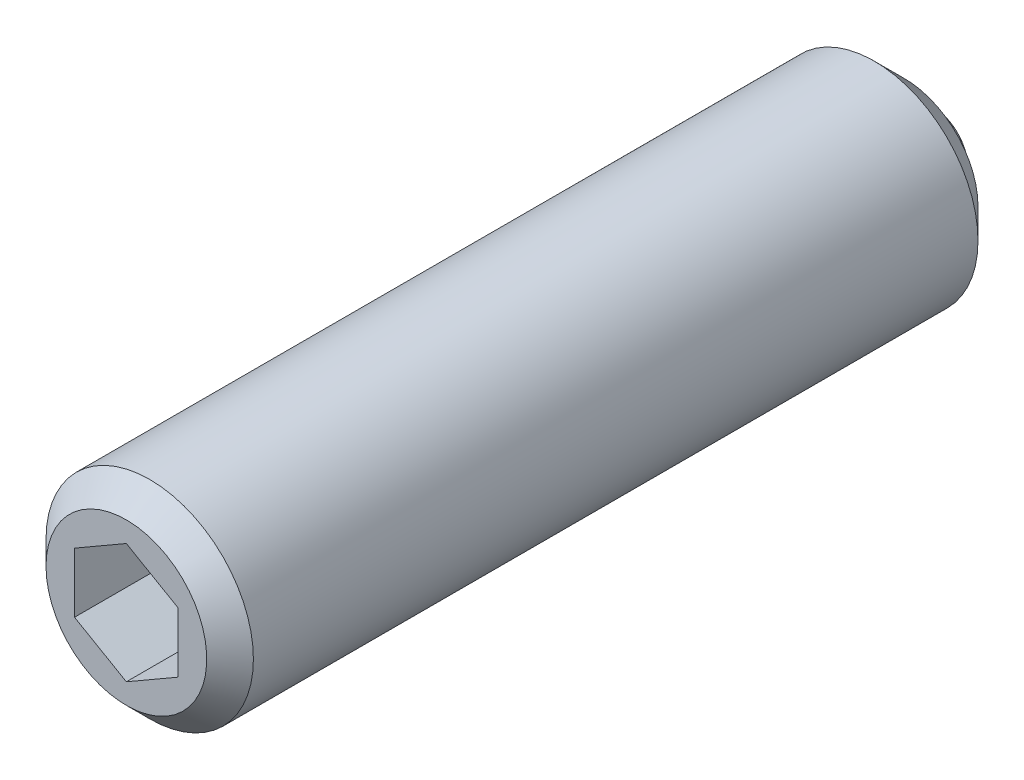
ISO-10303-21;
HEADER;
FILE_DESCRIPTION(('STEP AP214'),'2;1');
FILE_NAME('part.step','',(''),(''),'','','');
FILE_SCHEMA(('AUTOMOTIVE_DESIGN { 1 0 10303 214 1 1 1 1 }'));
ENDSEC;
DATA;
#1=APPLICATION_CONTEXT('core data for automotive mechanical design processes');
#2=APPLICATION_PROTOCOL_DEFINITION('international standard','automotive_design',2000,#1);
#3=PRODUCT_CONTEXT('',#1,'mechanical');
#4=PRODUCT('Part','Part','',(#3));
#5=PRODUCT_RELATED_PRODUCT_CATEGORY('part','',(#4));
#6=PRODUCT_DEFINITION_FORMATION('','',#4);
#7=PRODUCT_DEFINITION_CONTEXT('part definition',#1,'design');
#8=PRODUCT_DEFINITION('design','',#6,#7);
#9=PRODUCT_DEFINITION_SHAPE('','',#8);
#10=(LENGTH_UNIT() NAMED_UNIT(*) SI_UNIT(.MILLI.,.METRE.));
#11=(NAMED_UNIT(*) PLANE_ANGLE_UNIT() SI_UNIT($,.RADIAN.));
#12=(NAMED_UNIT(*) SI_UNIT($,.STERADIAN.) SOLID_ANGLE_UNIT());
#13=UNCERTAINTY_MEASURE_WITH_UNIT(LENGTH_MEASURE(1.E-05),#10,'distance_accuracy_value','');
#14=(GEOMETRIC_REPRESENTATION_CONTEXT(3) GLOBAL_UNCERTAINTY_ASSIGNED_CONTEXT((#13)) GLOBAL_UNIT_ASSIGNED_CONTEXT((#10,
#11,#12)) REPRESENTATION_CONTEXT('',''));
#15=CARTESIAN_POINT('',(0.,0.,0.));
#16=DIRECTION('',(0.,0.,1.));
#17=DIRECTION('',(1.,0.,0.));
#18=AXIS2_PLACEMENT_3D('',#15,#16,#17);
#19=CARTESIAN_POINT('',(1.03716958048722,3.87076958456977,31.5000000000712));
#20=DIRECTION('',(6.86296670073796E-11,0.,-1.));
#21=DIRECTION('',(0.500000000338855,-0.866025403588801,3.43250813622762E-11));
#22=AXIS2_PLACEMENT_3D('',#19,#20,#21);
#23=PLANE('',#22);
#24=CARTESIAN_POINT('',(-2.16183451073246E-09,3.72745200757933E-13,31.5));
#25=DIRECTION('',(6.86296670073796E-11,0.,-1.));
#26=DIRECTION('',(-1.,0.,-6.86296670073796E-11));
#27=AXIS2_PLACEMENT_3D('',#24,#25,#26);
#28=CIRCLE('',#27,3.1);
#29=CARTESIAN_POINT('',(-3.10000000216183,3.72745200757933E-13,31.4999999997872));
#30=VERTEX_POINT('',#29);
#31=EDGE_CURVE('E23',#30,#30,#28,.F.);
#32=ORIENTED_EDGE('',*,*,#31,.T.);
#33=EDGE_LOOP('',(#32));
#34=FACE_BOUND('',#33,.T.);
#35=DIRECTION('',(-0.866025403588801,-0.500000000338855,-5.94291184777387E-11));
#36=VECTOR('',#35,1.);
#37=CARTESIAN_POINT('',(-1.00000000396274,1.73205080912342,31.4999999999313));
#38=LINE('',#37,#36);
#39=CARTESIAN_POINT('',(-4.74585106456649E-09,2.30940107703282,31.5));
#40=VERTEX_POINT('',#39);
#41=CARTESIAN_POINT('',(-2.00000000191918,1.15470053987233,31.4999999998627));
#42=VERTEX_POINT('',#41);
#43=EDGE_CURVE('E86',#40,#42,#38,.T.);
#44=ORIENTED_EDGE('',*,*,#43,.F.);
#45=DIRECTION('',(0.866025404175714,-0.499999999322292,5.94409516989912E-11));
#46=VECTOR('',#45,1.);
#47=CARTESIAN_POINT('',(-4.75991273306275E-09,2.30940107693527,31.5));
#48=LINE('',#47,#46);
#49=CARTESIAN_POINT('',(1.9999999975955,1.15470053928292,31.5000000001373));
#50=VERTEX_POINT('',#49);
#51=EDGE_CURVE('E91',#50,#40,#48,.F.);
#52=ORIENTED_EDGE('',*,*,#51,.F.);
#53=DIRECTION('',(0.,-1.,0.));
#54=VECTOR('',#53,1.);
#55=CARTESIAN_POINT('',(1.9999999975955,1.15470053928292,31.5000000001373));
#56=LINE('',#55,#54);
#57=CARTESIAN_POINT('',(1.9999999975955,-1.15470053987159,31.5000000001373));
#58=VERTEX_POINT('',#57);
#59=EDGE_CURVE('E93',#58,#50,#56,.F.);
#60=ORIENTED_EDGE('',*,*,#59,.F.);
#61=DIRECTION('',(0.866025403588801,0.500000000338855,5.94291184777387E-11));
#62=VECTOR('',#61,1.);
#63=CARTESIAN_POINT('',(0.999999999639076,-1.73205080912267,31.5000000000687));
#64=LINE('',#63,#62);
#65=CARTESIAN_POINT('',(4.22186374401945E-10,-2.30940107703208,31.5));
#66=VERTEX_POINT('',#65);
#67=EDGE_CURVE('E264',#66,#58,#64,.T.);
#68=ORIENTED_EDGE('',*,*,#67,.F.);
#69=DIRECTION('',(-0.866025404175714,0.499999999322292,-5.94409516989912E-11));
#70=VECTOR('',#69,1.);
#71=CARTESIAN_POINT('',(4.36246308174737E-10,-2.30940107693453,31.5));
#72=LINE('',#71,#70);
#73=CARTESIAN_POINT('',(-2.00000000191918,-1.15470053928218,31.4999999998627));
#74=VERTEX_POINT('',#73);
#75=EDGE_CURVE('E60',#74,#66,#72,.F.);
#76=ORIENTED_EDGE('',*,*,#75,.F.);
#77=DIRECTION('',(0.,1.,0.));
#78=VECTOR('',#77,1.);
#79=CARTESIAN_POINT('',(-2.00000000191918,-1.15470053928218,31.4999999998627));
#80=LINE('',#79,#78);
#81=EDGE_CURVE('E82',#42,#74,#80,.F.);
#82=ORIENTED_EDGE('',*,*,#81,.F.);
#83=EDGE_LOOP('',(#44,#52,#60,#68,#76,#82));
#84=FACE_BOUND('',#83,.T.);
#85=ADVANCED_FACE('F14',(#34,#84),#23,.F.);
#86=CARTESIAN_POINT('',(0.999999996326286,2.88675134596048,27.5000000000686));
#87=DIRECTION('',(6.86296670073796E-11,0.,-1.));
#88=DIRECTION('',(0.500000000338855,-0.866025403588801,3.43250813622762E-11));
#89=AXIS2_PLACEMENT_3D('',#86,#87,#88);
#90=PLANE('',#89);
#91=DIRECTION('',(0.866025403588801,0.500000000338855,5.94291184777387E-11));
#92=VECTOR('',#91,1.);
#93=CARTESIAN_POINT('',(0.999999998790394,-1.73205080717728,27.5000000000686));
#94=LINE('',#93,#92);
#95=CARTESIAN_POINT('',(2.7752106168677E-11,-2.30940107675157,27.5));
#96=VERTEX_POINT('',#95);
#97=CARTESIAN_POINT('',(1.99999999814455,-1.15470053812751,27.5000000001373));
#98=VERTEX_POINT('',#97);
#99=EDGE_CURVE('E108',#96,#98,#94,.T.);
#100=ORIENTED_EDGE('',*,*,#99,.T.);
#101=DIRECTION('',(0.,1.,0.));
#102=VECTOR('',#101,1.);
#103=CARTESIAN_POINT('',(1.99999999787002,6.54242285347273E-11,27.5000000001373));
#104=LINE('',#103,#102);
#105=CARTESIAN_POINT('',(1.9999999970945,1.15470053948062,27.5000000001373));
#106=VERTEX_POINT('',#105);
#107=EDGE_CURVE('E104',#98,#106,#104,.T.);
#108=ORIENTED_EDGE('',*,*,#107,.T.);
#109=DIRECTION('',(-0.866025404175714,0.499999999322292,-5.94409516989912E-11));
#110=VECTOR('',#109,1.);
#111=CARTESIAN_POINT('',(0.999999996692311,1.73205080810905,27.5000000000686));
#112=LINE('',#111,#110);
#113=CARTESIAN_POINT('',(-3.80238158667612E-09,2.30940107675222,27.5));
#114=VERTEX_POINT('',#113);
#115=EDGE_CURVE('E100',#106,#114,#112,.T.);
#116=ORIENTED_EDGE('',*,*,#115,.T.);
#117=DIRECTION('',(-0.866025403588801,-0.500000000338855,-5.94291184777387E-11));
#118=VECTOR('',#117,1.);
#119=CARTESIAN_POINT('',(-1.00000000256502,1.73205080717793,27.4999999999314));
#120=LINE('',#119,#118);
#121=CARTESIAN_POINT('',(-2.00000000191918,1.15470053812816,27.4999999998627));
#122=VERTEX_POINT('',#121);
#123=EDGE_CURVE('E46',#114,#122,#120,.T.);
#124=ORIENTED_EDGE('',*,*,#123,.T.);
#125=DIRECTION('',(0.,-1.,0.));
#126=VECTOR('',#125,1.);
#127=CARTESIAN_POINT('',(-2.00000000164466,-6.4775008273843E-11,27.4999999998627));
#128=LINE('',#127,#126);
#129=CARTESIAN_POINT('',(-2.00000000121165,-1.15470053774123,27.4999999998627));
#130=VERTEX_POINT('',#129);
#131=EDGE_CURVE('E83',#122,#130,#128,.T.);
#132=ORIENTED_EDGE('',*,*,#131,.T.);
#133=DIRECTION('',(0.866025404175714,-0.499999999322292,5.94409516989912E-11));
#134=VECTOR('',#133,1.);
#135=CARTESIAN_POINT('',(-1.00000000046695,-1.7320508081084,27.4999999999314));
#136=LINE('',#135,#134);
#137=EDGE_CURVE('E31',#130,#96,#136,.T.);
#138=ORIENTED_EDGE('',*,*,#137,.T.);
#139=EDGE_LOOP('',(#100,#108,#116,#124,#132,#138));
#140=FACE_BOUND('',#139,.T.);
#141=ADVANCED_FACE('F136',(#140),#90,.F.);
#142=CARTESIAN_POINT('',(-2.00000000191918,-1.15470053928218,31.4999999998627));
#143=DIRECTION('',(-1.,0.,-6.86296670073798E-11));
#144=DIRECTION('',(0.,1.,0.));
#145=AXIS2_PLACEMENT_3D('',#142,#143,#144);
#146=PLANE('',#145);
#147=ORIENTED_EDGE('',*,*,#131,.F.);
#148=DIRECTION('',(6.86296670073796E-11,0.,-1.));
#149=VECTOR('',#148,1.);
#150=CARTESIAN_POINT('',(-2.00000000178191,1.1547005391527,29.4999999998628));
#151=LINE('',#150,#149);
#152=EDGE_CURVE('E80',#42,#122,#151,.T.);
#153=ORIENTED_EDGE('',*,*,#152,.F.);
#154=ORIENTED_EDGE('',*,*,#81,.T.);
#155=DIRECTION('',(-6.86296670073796E-11,0.,1.));
#156=VECTOR('',#155,1.);
#157=CARTESIAN_POINT('',(-2.00000000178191,-1.1547005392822,29.4999999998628));
#158=LINE('',#157,#156);
#159=EDGE_CURVE('E114',#130,#74,#158,.T.);
#160=ORIENTED_EDGE('',*,*,#159,.F.);
#161=EDGE_LOOP('',(#147,#153,#154,#160));
#162=FACE_BOUND('',#161,.T.);
#163=ADVANCED_FACE('F81',(#162),#146,.F.);
#164=CARTESIAN_POINT('',(4.36246308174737E-10,-2.30940107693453,31.5));
#165=DIRECTION('',(-0.499999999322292,-0.866025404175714,-3.43045856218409E-11));
#166=DIRECTION('',(-0.866025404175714,0.499999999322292,-5.94409516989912E-11));
#167=AXIS2_PLACEMENT_3D('',#164,#165,#166);
#168=PLANE('',#167);
#169=ORIENTED_EDGE('',*,*,#137,.F.);
#170=ORIENTED_EDGE('',*,*,#159,.T.);
#171=ORIENTED_EDGE('',*,*,#75,.T.);
#172=DIRECTION('',(6.86296670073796E-11,0.,-1.));
#173=VECTOR('',#172,1.);
#174=CARTESIAN_POINT('',(-7.92519912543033E-10,-2.30940107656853,29.5));
#175=LINE('',#174,#173);
#176=EDGE_CURVE('E107',#66,#96,#175,.T.);
#177=ORIENTED_EDGE('',*,*,#176,.T.);
#178=EDGE_LOOP('',(#169,#170,#171,#177));
#179=FACE_BOUND('',#178,.T.);
#180=ADVANCED_FACE('F148',(#179),#168,.F.);
#181=CARTESIAN_POINT('',(1.99999999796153,-1.15470053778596,31.5000000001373));
#182=DIRECTION('',(0.500000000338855,-0.866025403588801,3.43250813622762E-11));
#183=DIRECTION('',(-0.866025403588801,-0.500000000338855,-5.94291184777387E-11));
#184=AXIS2_PLACEMENT_3D('',#181,#182,#183);
#185=PLANE('',#184);
#186=ORIENTED_EDGE('',*,*,#99,.F.);
#187=ORIENTED_EDGE('',*,*,#176,.F.);
#188=ORIENTED_EDGE('',*,*,#67,.T.);
#189=DIRECTION('',(6.86296670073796E-11,0.,-1.));
#190=VECTOR('',#189,1.);
#191=CARTESIAN_POINT('',(1.99999999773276,-1.154700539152,29.5000000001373));
#192=LINE('',#191,#190);
#193=EDGE_CURVE('E97',#58,#98,#192,.T.);
#194=ORIENTED_EDGE('',*,*,#193,.T.);
#195=EDGE_LOOP('',(#186,#187,#188,#194));
#196=FACE_BOUND('',#195,.T.);
#197=ADVANCED_FACE('F159',(#196),#185,.F.);
#198=CARTESIAN_POINT('',(1.9999999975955,1.15470053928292,31.5000000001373));
#199=DIRECTION('',(1.,0.,6.86296670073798E-11));
#200=DIRECTION('',(0.,-1.,0.));
#201=AXIS2_PLACEMENT_3D('',#198,#199,#200);
#202=PLANE('',#201);
#203=ORIENTED_EDGE('',*,*,#107,.F.);
#204=ORIENTED_EDGE('',*,*,#193,.F.);
#205=ORIENTED_EDGE('',*,*,#59,.T.);
#206=DIRECTION('',(6.86296670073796E-11,0.,-1.));
#207=VECTOR('',#206,1.);
#208=CARTESIAN_POINT('',(1.99999999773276,1.1547005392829,29.5000000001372));
#209=LINE('',#208,#207);
#210=EDGE_CURVE('E101',#50,#106,#209,.T.);
#211=ORIENTED_EDGE('',*,*,#210,.T.);
#212=EDGE_LOOP('',(#203,#204,#205,#211));
#213=FACE_BOUND('',#212,.T.);
#214=ADVANCED_FACE('F155',(#213),#202,.F.);
#215=CARTESIAN_POINT('',(-4.75991273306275E-09,2.30940107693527,31.5));
#216=DIRECTION('',(0.499999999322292,0.866025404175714,3.43045856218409E-11));
#217=DIRECTION('',(0.866025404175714,-0.499999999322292,5.94409516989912E-11));
#218=AXIS2_PLACEMENT_3D('',#215,#216,#217);
#219=PLANE('',#218);
#220=ORIENTED_EDGE('',*,*,#115,.F.);
#221=ORIENTED_EDGE('',*,*,#210,.F.);
#222=ORIENTED_EDGE('',*,*,#51,.T.);
#223=DIRECTION('',(6.86296670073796E-11,0.,-1.));
#224=VECTOR('',#223,1.);
#225=CARTESIAN_POINT('',(-3.25662825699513E-09,2.30940107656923,29.5));
#226=LINE('',#225,#224);
#227=EDGE_CURVE('E74',#40,#114,#226,.T.);
#228=ORIENTED_EDGE('',*,*,#227,.T.);
#229=EDGE_LOOP('',(#220,#221,#222,#228));
#230=FACE_BOUND('',#229,.T.);
#231=ADVANCED_FACE('F152',(#230),#219,.F.);
#232=CARTESIAN_POINT('',(-2.0000000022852,1.1547005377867,31.4999999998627));
#233=DIRECTION('',(-0.500000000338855,0.866025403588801,-3.43250813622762E-11));
#234=DIRECTION('',(0.866025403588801,0.500000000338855,5.94291184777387E-11));
#235=AXIS2_PLACEMENT_3D('',#232,#233,#234);
#236=PLANE('',#235);
#237=ORIENTED_EDGE('',*,*,#123,.F.);
#238=ORIENTED_EDGE('',*,*,#227,.F.);
#239=ORIENTED_EDGE('',*,*,#43,.T.);
#240=ORIENTED_EDGE('',*,*,#152,.T.);
#241=EDGE_LOOP('',(#237,#238,#239,#240));
#242=FACE_BOUND('',#241,.T.);
#243=ADVANCED_FACE('F90',(#242),#236,.F.);
#244=CARTESIAN_POINT('',(-1.02944500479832E-10,0.,1.49999999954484));
#245=DIRECTION('',(-6.86296670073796E-11,0.,1.));
#246=DIRECTION('',(1.,0.,6.86296670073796E-11));
#247=AXIS2_PLACEMENT_3D('',#244,#245,#246);
#248=CYLINDRICAL_SURFACE('',#247,4.);
#249=CARTESIAN_POINT('',(-2.10006781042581E-09,3.62095337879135E-13,30.6));
#250=DIRECTION('',(6.862966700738E-11,0.,-1.));
#251=DIRECTION('',(-1.,0.,-6.862966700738E-11));
#252=AXIS2_PLACEMENT_3D('',#249,#250,#251);
#253=CIRCLE('',#252,4.);
#254=CARTESIAN_POINT('',(-4.00000000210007,3.62095337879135E-13,30.5999999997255));
#255=VERTEX_POINT('',#254);
#256=EDGE_CURVE('E9',#255,#255,#253,.T.);
#257=ORIENTED_EDGE('',*,*,#256,.T.);
#258=EDGE_LOOP('',(#257));
#259=FACE_BOUND('',#258,.T.);
#260=CARTESIAN_POINT('',(-1.8186861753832E-10,0.,2.64999999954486));
#261=DIRECTION('',(-6.86296670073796E-11,0.,1.));
#262=DIRECTION('',(1.,0.,6.86296670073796E-11));
#263=AXIS2_PLACEMENT_3D('',#260,#261,#262);
#264=CIRCLE('',#263,4.);
#265=CARTESIAN_POINT('',(3.99999999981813,0.,2.64999999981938));
#266=VERTEX_POINT('',#265);
#267=EDGE_CURVE('E106',#266,#266,#264,.T.);
#268=ORIENTED_EDGE('',*,*,#267,.T.);
#269=EDGE_LOOP('',(#268));
#270=FACE_BOUND('',#269,.T.);
#271=ADVANCED_FACE('F151',(#259,#270),#248,.T.);
#272=CARTESIAN_POINT('',(3.9398904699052,-1.05569046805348,1.50000000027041));
#273=DIRECTION('',(-6.86296670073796E-11,0.,1.));
#274=DIRECTION('',(-0.500000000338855,0.866025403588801,-3.43250813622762E-11));
#275=AXIS2_PLACEMENT_3D('',#272,#273,#274);
#276=PLANE('',#275);
#277=CARTESIAN_POINT('',(-1.0294450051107E-10,0.,1.5));
#278=DIRECTION('',(-6.86296670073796E-11,0.,1.));
#279=DIRECTION('',(1.,0.,6.86296670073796E-11));
#280=AXIS2_PLACEMENT_3D('',#277,#278,#279);
#281=CIRCLE('',#280,2.85000000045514);
#282=CARTESIAN_POINT('',(2.85000000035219,0.,1.50000000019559));
#283=VERTEX_POINT('',#282);
#284=EDGE_CURVE('E119',#283,#283,#281,.F.);
#285=ORIENTED_EDGE('',*,*,#284,.T.);
#286=EDGE_LOOP('',(#285));
#287=FACE_BOUND('',#286,.T.);
#288=CARTESIAN_POINT('',(6.86306746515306E-11,0.,1.5));
#289=DIRECTION('',(-6.86296670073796E-11,0.,1.));
#290=DIRECTION('',(1.,0.,6.86296670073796E-11));
#291=AXIS2_PLACEMENT_3D('',#288,#289,#290);
#292=CIRCLE('',#291,2.29128784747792);
#293=CARTESIAN_POINT('',(2.29128784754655,0.,1.50000000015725));
#294=VERTEX_POINT('',#293);
#295=EDGE_CURVE('E88',#294,#294,#292,.T.);
#296=ORIENTED_EDGE('',*,*,#295,.T.);
#297=EDGE_LOOP('',(#296));
#298=FACE_BOUND('',#297,.T.);
#299=ADVANCED_FACE('F144',(#287,#298),#276,.F.);
#300=CARTESIAN_POINT('',(0.,0.,2.5));
#301=DIRECTION('',(0.,0.,-1.));
#302=DIRECTION('',(-1.,0.,0.));
#303=AXIS2_PLACEMENT_3D('',#300,#301,#302);
#304=SPHERICAL_SURFACE('',#303,2.5);
#305=ORIENTED_EDGE('',*,*,#295,.F.);
#306=EDGE_LOOP('',(#305));
#307=FACE_BOUND('',#306,.T.);
#308=ADVANCED_FACE('F132',(#307),#304,.T.);
#309=CARTESIAN_POINT('',(-1.8186861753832E-10,0.,2.64999999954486));
#310=DIRECTION('',(-6.86296670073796E-11,0.,1.));
#311=DIRECTION('',(1.,0.,6.86296670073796E-11));
#312=AXIS2_PLACEMENT_3D('',#309,#310,#311);
#313=CONICAL_SURFACE('',#312,4.,0.78539816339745);
#314=ORIENTED_EDGE('',*,*,#284,.F.);
#315=EDGE_LOOP('',(#314));
#316=FACE_BOUND('',#315,.T.);
#317=ORIENTED_EDGE('',*,*,#267,.F.);
#318=EDGE_LOOP('',(#317));
#319=FACE_BOUND('',#318,.T.);
#320=ADVANCED_FACE('F126',(#316,#319),#313,.T.);
#321=CARTESIAN_POINT('',(-2.16183451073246E-09,3.72745200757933E-13,31.5));
#322=DIRECTION('',(6.862966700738E-11,0.,-1.));
#323=DIRECTION('',(-1.,0.,-6.862966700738E-11));
#324=AXIS2_PLACEMENT_3D('',#321,#322,#323);
#325=CONICAL_SURFACE('',#324,3.1,0.785398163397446);
#326=ORIENTED_EDGE('',*,*,#256,.F.);
#327=EDGE_LOOP('',(#326));
#328=FACE_BOUND('',#327,.T.);
#329=ORIENTED_EDGE('',*,*,#31,.F.);
#330=EDGE_LOOP('',(#329));
#331=FACE_BOUND('',#330,.T.);
#332=ADVANCED_FACE('F16',(#328,#331),#325,.T.);
#333=CLOSED_SHELL('',(#85,#141,#163,#180,#197,#214,#231,#243,#271,#299,#308,#320,#332));
#334=MANIFOLD_SOLID_BREP('B1',#333);
#335=ADVANCED_BREP_SHAPE_REPRESENTATION('',(#18,#334),#14);
#336=SHAPE_DEFINITION_REPRESENTATION(#9,#335);
ENDSEC;
END-ISO-10303-21;
